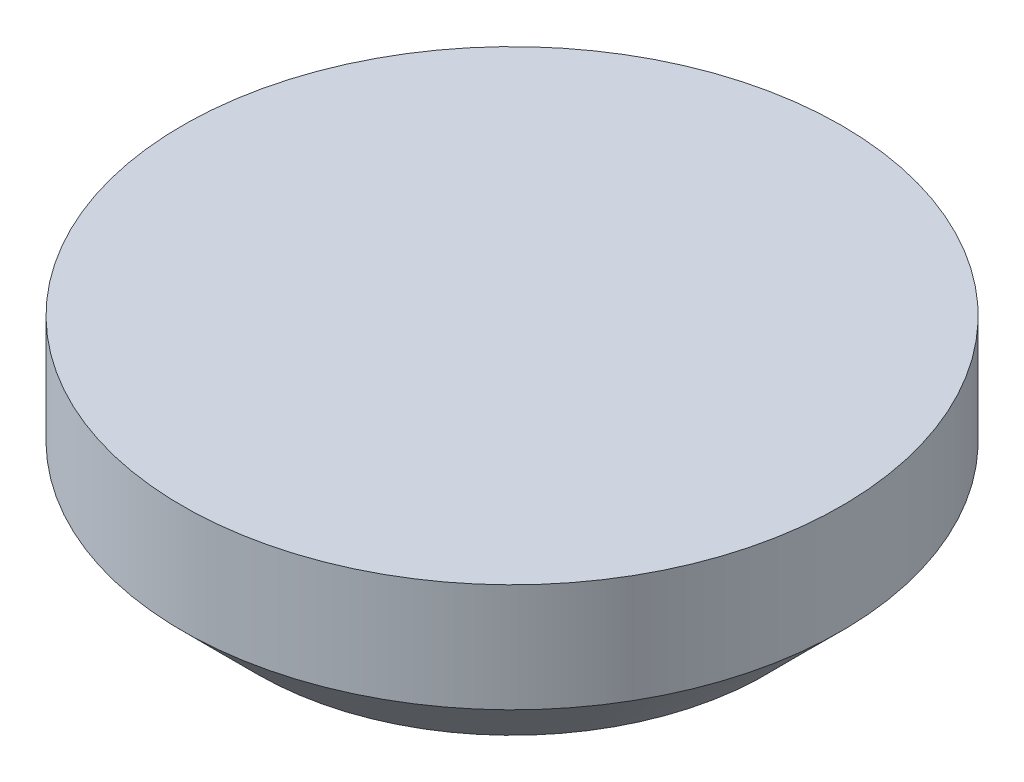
from build123d import *


with BuildPart() as part:
    # Sketch 1 → Revolve 1 (revolve)
    with BuildSketch(Plane.XY, mode=Mode.PRIVATE) as revolve_1_sk:
        Polygon((0, 390), (700, 390), (700, 160), (540, 0), (0, 0), align=None)
    revolve(revolve_1_sk.sketch.rotate(Axis((0, 0, 0), (0, 1, 0)), 90), axis=Axis((0, 0, 0), (0, 1, 0)))


solid = part.part
